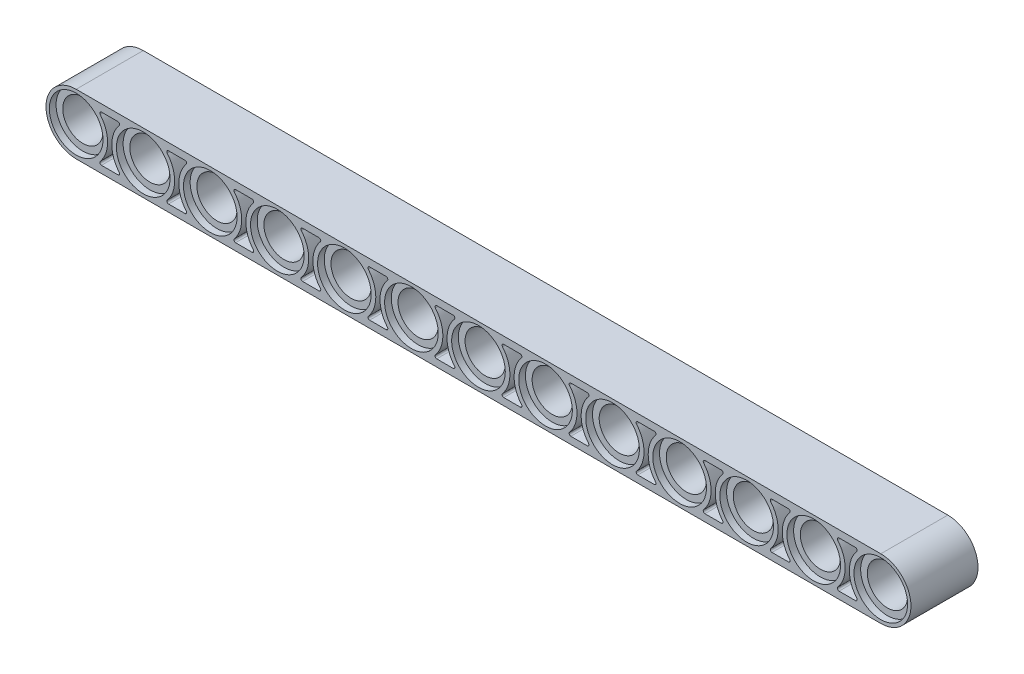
from build123d import *

# Parameters (mm, degrees)
BODY_DEPTH                              = 4
CBORE_FOR_M5_HEX_HEAD_BOLT1_D           = 4.8
CBORE_FOR_M5_HEX_HEAD_BOLT1_CBORE_D     = 6.4
CBORE_FOR_M5_HEX_HEAD_BOLT1_CBORE_DEPTH = 0.8
CBORE_FOR_M5_HEX_HEAD_BOLT2_D           = 4.8
CBORE_FOR_M5_HEX_HEAD_BOLT2_CBORE_D     = 6.4
CBORE_FOR_M5_HEX_HEAD_BOLT2_CBORE_DEPTH = 0.8
CUT_OUT_DEPTH                           = 3.4
CUT_OUT_PATTERN_COUNT                   = 12
CUT_OUT_PATTERN_PITCH                   = 8
CUT_OUT_PATTERN_COPY_1_DEPTH            = 3.4
CUT_OUT_PATTERN_COPY_2_DEPTH            = 3.4
CUT_OUT_PATTERN_COPY_3_DEPTH            = 3.4
CUT_OUT_PATTERN_COPY_4_DEPTH            = 3.4
CUT_OUT_PATTERN_COPY_5_DEPTH            = 3.4
CUT_OUT_PATTERN_COPY_6_DEPTH            = 3.4
CUT_OUT_PATTERN_COPY_7_DEPTH            = 3.4
CUT_OUT_PATTERN_COPY_8_DEPTH            = 3.4
CUT_OUT_PATTERN_COPY_9_DEPTH            = 3.4
CUT_OUT_PATTERN_COPY_10_DEPTH           = 3.4
CUT_OUT_PATTERN_COPY_11_DEPTH           = 3.4
HOLE_PATTERN_COUNT                      = 13
HOLE_PATTERN_PITCH                      = 8


with BuildPart() as part:
    # Sketch1 → Body (new, symmetric)
    with BuildSketch(Plane.XY):
        with BuildLine():
            Line((0, 3.6), (96, 3.6))
            ThreePointArc((96, 3.6), (99.6, 0), (96, -3.6))
            Line((96, -3.6), (0, -3.6))
            ThreePointArc((0, -3.6), (-3.6, 0), (0, 3.6))
        make_face()
    extrude(amount=BODY_DEPTH, both=True)

    # CBORE for M5 Hex Head Bolt1 (through all)
    with Locations(Plane.XY.offset(4)):
        with Locations((0, 0)):
            cbore_for_m5_hex_head_bolt1 = CounterBoreHole(CBORE_FOR_M5_HEX_HEAD_BOLT1_D / 2, CBORE_FOR_M5_HEX_HEAD_BOLT1_CBORE_D / 2, CBORE_FOR_M5_HEX_HEAD_BOLT1_CBORE_DEPTH)

    # CBORE for M5 Hex Head Bolt2 (through all)
    with Locations(Plane(origin=(0, 0, -4), x_dir=(-1, 0, 0), z_dir=(0, 0, -1))):
        with Locations((0, 0)):
            cbore_for_m5_hex_head_bolt2 = CounterBoreHole(CBORE_FOR_M5_HEX_HEAD_BOLT2_D / 2, CBORE_FOR_M5_HEX_HEAD_BOLT2_CBORE_D / 2, CBORE_FOR_M5_HEX_HEAD_BOLT2_CBORE_DEPTH)

    # Sketch3 → Cut Out (cut)
    with BuildSketch(Plane.XY.offset(4)):
        with BuildLine():
            Line((3.016620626, 2.75), (4.983379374, 2.75))
            ThreePointArc((4.983379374, 2.75), (5.164794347, 2.634193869), (5.136119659, 2.420886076))
            ThreePointArc((5.136119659, 2.420886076), (4.25, 0), (5.136119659, -2.420886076))
            ThreePointArc((5.136119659, -2.420886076), (5.164794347, -2.634193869), (4.983379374, -2.75))
            Line((4.983379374, -2.75), (3.016620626, -2.75))
            ThreePointArc((3.016620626, -2.75), (2.835205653, -2.634193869), (2.863880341, -2.420886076))
            ThreePointArc((2.863880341, -2.420886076), (3.75, 0), (2.863880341, 2.420886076))
            ThreePointArc((2.863880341, 2.420886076), (2.835205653, 2.634193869), (3.016620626, 2.75))
        make_face()
    cut_out = extrude(amount=-CUT_OUT_DEPTH, mode=Mode.SUBTRACT)

    # Mirror1: Cut Out across plane
    add(cut_out.mirror(Plane.XY), mode=Mode.SUBTRACT)

    # CUT OUT Pattern: Cut Out ×12
    with Locations(*[(i * CUT_OUT_PATTERN_PITCH, 0, 0) for i in range(1, CUT_OUT_PATTERN_COUNT)]):
        add(cut_out, mode=Mode.SUBTRACT)

    # CUT OUT Pattern copy 1 sketch → CUT OUT Pattern copy 1 (cut)
    with BuildSketch(Plane(origin=(8, 0, -4), x_dir=(1, 0, 0), z_dir=(0, 0, -1))):
        with BuildLine():
            Line((3.016620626, -2.75), (4.983379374, -2.75))
            ThreePointArc((4.983379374, -2.75), (5.164794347, -2.634193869), (5.136119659, -2.420886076))
            ThreePointArc((5.136119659, -2.420886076), (4.25, 0), (5.136119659, 2.420886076))
            ThreePointArc((5.136119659, 2.420886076), (5.164794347, 2.634193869), (4.983379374, 2.75))
            Line((4.983379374, 2.75), (3.016620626, 2.75))
            ThreePointArc((3.016620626, 2.75), (2.835205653, 2.634193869), (2.863880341, 2.420886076))
            ThreePointArc((2.863880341, 2.420886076), (3.75, 0), (2.863880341, -2.420886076))
            ThreePointArc((2.863880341, -2.420886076), (2.835205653, -2.634193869), (3.016620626, -2.75))
        make_face()
    extrude(amount=-CUT_OUT_PATTERN_COPY_1_DEPTH, mode=Mode.SUBTRACT)

    # CUT OUT Pattern copy 2 sketch → CUT OUT Pattern copy 2 (cut)
    with BuildSketch(Plane(origin=(16, 0, -4), x_dir=(1, 0, 0), z_dir=(0, 0, -1))):
        with BuildLine():
            Line((3.016620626, -2.75), (4.983379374, -2.75))
            ThreePointArc((4.983379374, -2.75), (5.164794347, -2.634193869), (5.136119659, -2.420886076))
            ThreePointArc((5.136119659, -2.420886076), (4.25, 0), (5.136119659, 2.420886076))
            ThreePointArc((5.136119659, 2.420886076), (5.164794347, 2.634193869), (4.983379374, 2.75))
            Line((4.983379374, 2.75), (3.016620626, 2.75))
            ThreePointArc((3.016620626, 2.75), (2.835205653, 2.634193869), (2.863880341, 2.420886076))
            ThreePointArc((2.863880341, 2.420886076), (3.75, 0), (2.863880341, -2.420886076))
            ThreePointArc((2.863880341, -2.420886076), (2.835205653, -2.634193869), (3.016620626, -2.75))
        make_face()
    extrude(amount=-CUT_OUT_PATTERN_COPY_2_DEPTH, mode=Mode.SUBTRACT)

    # CUT OUT Pattern copy 3 sketch → CUT OUT Pattern copy 3 (cut)
    with BuildSketch(Plane(origin=(24, 0, -4), x_dir=(1, 0, 0), z_dir=(0, 0, -1))):
        with BuildLine():
            Line((3.016620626, -2.75), (4.983379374, -2.75))
            ThreePointArc((4.983379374, -2.75), (5.164794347, -2.634193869), (5.136119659, -2.420886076))
            ThreePointArc((5.136119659, -2.420886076), (4.25, 0), (5.136119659, 2.420886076))
            ThreePointArc((5.136119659, 2.420886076), (5.164794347, 2.634193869), (4.983379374, 2.75))
            Line((4.983379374, 2.75), (3.016620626, 2.75))
            ThreePointArc((3.016620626, 2.75), (2.835205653, 2.634193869), (2.863880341, 2.420886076))
            ThreePointArc((2.863880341, 2.420886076), (3.75, 0), (2.863880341, -2.420886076))
            ThreePointArc((2.863880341, -2.420886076), (2.835205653, -2.634193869), (3.016620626, -2.75))
        make_face()
    extrude(amount=-CUT_OUT_PATTERN_COPY_3_DEPTH, mode=Mode.SUBTRACT)

    # CUT OUT Pattern copy 4 sketch → CUT OUT Pattern copy 4 (cut)
    with BuildSketch(Plane(origin=(32, 0, -4), x_dir=(1, 0, 0), z_dir=(0, 0, -1))):
        with BuildLine():
            Line((3.016620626, -2.75), (4.983379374, -2.75))
            ThreePointArc((4.983379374, -2.75), (5.164794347, -2.634193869), (5.136119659, -2.420886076))
            ThreePointArc((5.136119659, -2.420886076), (4.25, 0), (5.136119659, 2.420886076))
            ThreePointArc((5.136119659, 2.420886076), (5.164794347, 2.634193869), (4.983379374, 2.75))
            Line((4.983379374, 2.75), (3.016620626, 2.75))
            ThreePointArc((3.016620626, 2.75), (2.835205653, 2.634193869), (2.863880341, 2.420886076))
            ThreePointArc((2.863880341, 2.420886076), (3.75, 0), (2.863880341, -2.420886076))
            ThreePointArc((2.863880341, -2.420886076), (2.835205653, -2.634193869), (3.016620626, -2.75))
        make_face()
    extrude(amount=-CUT_OUT_PATTERN_COPY_4_DEPTH, mode=Mode.SUBTRACT)

    # CUT OUT Pattern copy 5 sketch → CUT OUT Pattern copy 5 (cut)
    with BuildSketch(Plane(origin=(40, 0, -4), x_dir=(1, 0, 0), z_dir=(0, 0, -1))):
        with BuildLine():
            Line((3.016620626, -2.75), (4.983379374, -2.75))
            ThreePointArc((4.983379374, -2.75), (5.164794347, -2.634193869), (5.136119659, -2.420886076))
            ThreePointArc((5.136119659, -2.420886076), (4.25, 0), (5.136119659, 2.420886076))
            ThreePointArc((5.136119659, 2.420886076), (5.164794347, 2.634193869), (4.983379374, 2.75))
            Line((4.983379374, 2.75), (3.016620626, 2.75))
            ThreePointArc((3.016620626, 2.75), (2.835205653, 2.634193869), (2.863880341, 2.420886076))
            ThreePointArc((2.863880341, 2.420886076), (3.75, 0), (2.863880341, -2.420886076))
            ThreePointArc((2.863880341, -2.420886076), (2.835205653, -2.634193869), (3.016620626, -2.75))
        make_face()
    extrude(amount=-CUT_OUT_PATTERN_COPY_5_DEPTH, mode=Mode.SUBTRACT)

    # CUT OUT Pattern copy 6 sketch → CUT OUT Pattern copy 6 (cut)
    with BuildSketch(Plane(origin=(48, 0, -4), x_dir=(1, 0, 0), z_dir=(0, 0, -1))):
        with BuildLine():
            Line((3.016620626, -2.75), (4.983379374, -2.75))
            ThreePointArc((4.983379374, -2.75), (5.164794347, -2.634193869), (5.136119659, -2.420886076))
            ThreePointArc((5.136119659, -2.420886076), (4.25, 0), (5.136119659, 2.420886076))
            ThreePointArc((5.136119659, 2.420886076), (5.164794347, 2.634193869), (4.983379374, 2.75))
            Line((4.983379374, 2.75), (3.016620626, 2.75))
            ThreePointArc((3.016620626, 2.75), (2.835205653, 2.634193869), (2.863880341, 2.420886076))
            ThreePointArc((2.863880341, 2.420886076), (3.75, 0), (2.863880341, -2.420886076))
            ThreePointArc((2.863880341, -2.420886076), (2.835205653, -2.634193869), (3.016620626, -2.75))
        make_face()
    extrude(amount=-CUT_OUT_PATTERN_COPY_6_DEPTH, mode=Mode.SUBTRACT)

    # CUT OUT Pattern copy 7 sketch → CUT OUT Pattern copy 7 (cut)
    with BuildSketch(Plane(origin=(56, 0, -4), x_dir=(1, 0, 0), z_dir=(0, 0, -1))):
        with BuildLine():
            Line((3.016620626, -2.75), (4.983379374, -2.75))
            ThreePointArc((4.983379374, -2.75), (5.164794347, -2.634193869), (5.136119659, -2.420886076))
            ThreePointArc((5.136119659, -2.420886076), (4.25, 0), (5.136119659, 2.420886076))
            ThreePointArc((5.136119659, 2.420886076), (5.164794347, 2.634193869), (4.983379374, 2.75))
            Line((4.983379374, 2.75), (3.016620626, 2.75))
            ThreePointArc((3.016620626, 2.75), (2.835205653, 2.634193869), (2.863880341, 2.420886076))
            ThreePointArc((2.863880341, 2.420886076), (3.75, 0), (2.863880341, -2.420886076))
            ThreePointArc((2.863880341, -2.420886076), (2.835205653, -2.634193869), (3.016620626, -2.75))
        make_face()
    extrude(amount=-CUT_OUT_PATTERN_COPY_7_DEPTH, mode=Mode.SUBTRACT)

    # CUT OUT Pattern copy 8 sketch → CUT OUT Pattern copy 8 (cut)
    with BuildSketch(Plane(origin=(64, 0, -4), x_dir=(1, 0, 0), z_dir=(0, 0, -1))):
        with BuildLine():
            Line((3.016620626, -2.75), (4.983379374, -2.75))
            ThreePointArc((4.983379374, -2.75), (5.164794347, -2.634193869), (5.136119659, -2.420886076))
            ThreePointArc((5.136119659, -2.420886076), (4.25, 0), (5.136119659, 2.420886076))
            ThreePointArc((5.136119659, 2.420886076), (5.164794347, 2.634193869), (4.983379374, 2.75))
            Line((4.983379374, 2.75), (3.016620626, 2.75))
            ThreePointArc((3.016620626, 2.75), (2.835205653, 2.634193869), (2.863880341, 2.420886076))
            ThreePointArc((2.863880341, 2.420886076), (3.75, 0), (2.863880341, -2.420886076))
            ThreePointArc((2.863880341, -2.420886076), (2.835205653, -2.634193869), (3.016620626, -2.75))
        make_face()
    extrude(amount=-CUT_OUT_PATTERN_COPY_8_DEPTH, mode=Mode.SUBTRACT)

    # CUT OUT Pattern copy 9 sketch → CUT OUT Pattern copy 9 (cut)
    with BuildSketch(Plane(origin=(72, 0, -4), x_dir=(1, 0, 0), z_dir=(0, 0, -1))):
        with BuildLine():
            Line((3.016620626, -2.75), (4.983379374, -2.75))
            ThreePointArc((4.983379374, -2.75), (5.164794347, -2.634193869), (5.136119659, -2.420886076))
            ThreePointArc((5.136119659, -2.420886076), (4.25, 0), (5.136119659, 2.420886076))
            ThreePointArc((5.136119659, 2.420886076), (5.164794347, 2.634193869), (4.983379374, 2.75))
            Line((4.983379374, 2.75), (3.016620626, 2.75))
            ThreePointArc((3.016620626, 2.75), (2.835205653, 2.634193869), (2.863880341, 2.420886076))
            ThreePointArc((2.863880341, 2.420886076), (3.75, 0), (2.863880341, -2.420886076))
            ThreePointArc((2.863880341, -2.420886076), (2.835205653, -2.634193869), (3.016620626, -2.75))
        make_face()
    extrude(amount=-CUT_OUT_PATTERN_COPY_9_DEPTH, mode=Mode.SUBTRACT)

    # CUT OUT Pattern copy 10 sketch → CUT OUT Pattern copy 10 (cut)
    with BuildSketch(Plane(origin=(80, 0, -4), x_dir=(1, 0, 0), z_dir=(0, 0, -1))):
        with BuildLine():
            Line((3.016620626, -2.75), (4.983379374, -2.75))
            ThreePointArc((4.983379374, -2.75), (5.164794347, -2.634193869), (5.136119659, -2.420886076))
            ThreePointArc((5.136119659, -2.420886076), (4.25, 0), (5.136119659, 2.420886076))
            ThreePointArc((5.136119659, 2.420886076), (5.164794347, 2.634193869), (4.983379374, 2.75))
            Line((4.983379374, 2.75), (3.016620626, 2.75))
            ThreePointArc((3.016620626, 2.75), (2.835205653, 2.634193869), (2.863880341, 2.420886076))
            ThreePointArc((2.863880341, 2.420886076), (3.75, 0), (2.863880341, -2.420886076))
            ThreePointArc((2.863880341, -2.420886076), (2.835205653, -2.634193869), (3.016620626, -2.75))
        make_face()
    extrude(amount=-CUT_OUT_PATTERN_COPY_10_DEPTH, mode=Mode.SUBTRACT)

    # CUT OUT Pattern copy 11 sketch → CUT OUT Pattern copy 11 (cut)
    with BuildSketch(Plane(origin=(88, 0, -4), x_dir=(1, 0, 0), z_dir=(0, 0, -1))):
        with BuildLine():
            Line((3.016620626, -2.75), (4.983379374, -2.75))
            ThreePointArc((4.983379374, -2.75), (5.164794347, -2.634193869), (5.136119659, -2.420886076))
            ThreePointArc((5.136119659, -2.420886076), (4.25, 0), (5.136119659, 2.420886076))
            ThreePointArc((5.136119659, 2.420886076), (5.164794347, 2.634193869), (4.983379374, 2.75))
            Line((4.983379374, 2.75), (3.016620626, 2.75))
            ThreePointArc((3.016620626, 2.75), (2.835205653, 2.634193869), (2.863880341, 2.420886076))
            ThreePointArc((2.863880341, 2.420886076), (3.75, 0), (2.863880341, -2.420886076))
            ThreePointArc((2.863880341, -2.420886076), (2.835205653, -2.634193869), (3.016620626, -2.75))
        make_face()
    extrude(amount=-CUT_OUT_PATTERN_COPY_11_DEPTH, mode=Mode.SUBTRACT)

    # Hole Pattern: CBORE for M5 Hex Head Bolt1, CBORE for M5 Hex Head Bolt2 ×13
    with Locations(*[(i * HOLE_PATTERN_PITCH, 0, 0) for i in range(1, HOLE_PATTERN_COUNT)]):
        add(cbore_for_m5_hex_head_bolt1, mode=Mode.SUBTRACT)
        add(cbore_for_m5_hex_head_bolt2, mode=Mode.SUBTRACT)


solid = part.part
